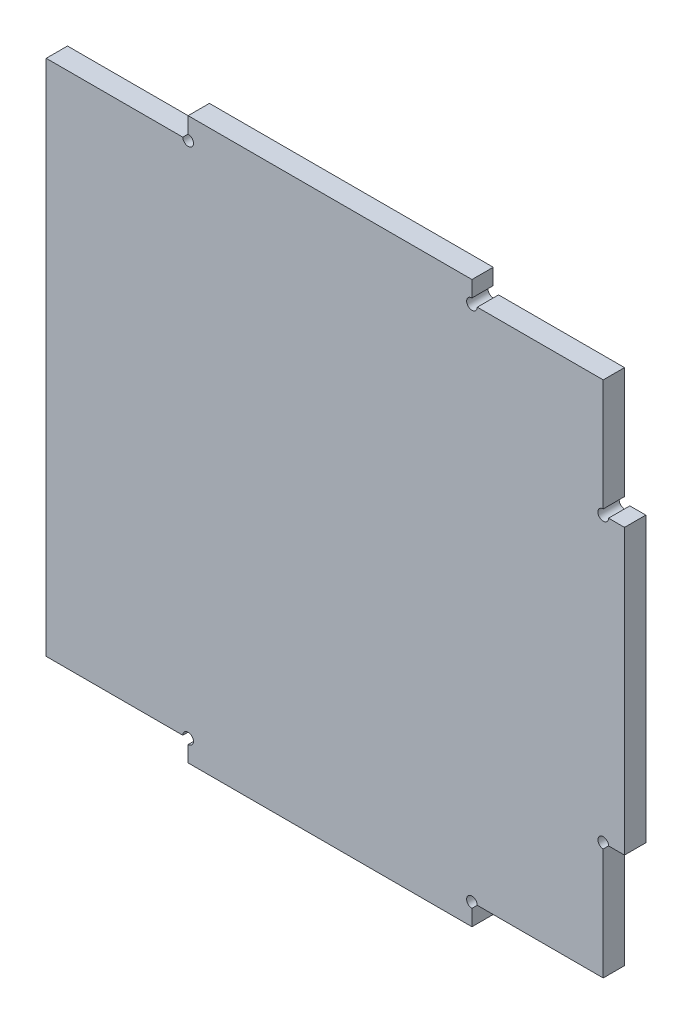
ISO-10303-21;
HEADER;
FILE_DESCRIPTION(('STEP AP214'),'2;1');
FILE_NAME('part.step','',(''),(''),'','','');
FILE_SCHEMA(('AUTOMOTIVE_DESIGN { 1 0 10303 214 1 1 1 1 }'));
ENDSEC;
DATA;
#1=APPLICATION_CONTEXT('core data for automotive mechanical design processes');
#2=APPLICATION_PROTOCOL_DEFINITION('international standard','automotive_design',2000,#1);
#3=PRODUCT_CONTEXT('',#1,'mechanical');
#4=PRODUCT('Part','Part','',(#3));
#5=PRODUCT_RELATED_PRODUCT_CATEGORY('part','',(#4));
#6=PRODUCT_DEFINITION_FORMATION('','',#4);
#7=PRODUCT_DEFINITION_CONTEXT('part definition',#1,'design');
#8=PRODUCT_DEFINITION('design','',#6,#7);
#9=PRODUCT_DEFINITION_SHAPE('','',#8);
#10=(LENGTH_UNIT() NAMED_UNIT(*) SI_UNIT(.MILLI.,.METRE.));
#11=(NAMED_UNIT(*) PLANE_ANGLE_UNIT() SI_UNIT($,.RADIAN.));
#12=(NAMED_UNIT(*) SI_UNIT($,.STERADIAN.) SOLID_ANGLE_UNIT());
#13=UNCERTAINTY_MEASURE_WITH_UNIT(LENGTH_MEASURE(1.E-05),#10,'distance_accuracy_value','');
#14=(GEOMETRIC_REPRESENTATION_CONTEXT(3) GLOBAL_UNCERTAINTY_ASSIGNED_CONTEXT((#13)) GLOBAL_UNIT_ASSIGNED_CONTEXT((#10,
#11,#12)) REPRESENTATION_CONTEXT('',''));
#15=CARTESIAN_POINT('',(0.,0.,0.));
#16=DIRECTION('',(0.,0.,1.));
#17=DIRECTION('',(1.,0.,0.));
#18=AXIS2_PLACEMENT_3D('',#15,#16,#17);
#19=CARTESIAN_POINT('',(-97.629050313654,-3.7639470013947,6.));
#20=DIRECTION('',(1.,0.,0.));
#21=DIRECTION('',(0.,0.,-1.));
#22=AXIS2_PLACEMENT_3D('',#19,#20,#21);
#23=PLANE('',#22);
#24=DIRECTION('',(0.,-1.,0.));
#25=VECTOR('',#24,1.);
#26=CARTESIAN_POINT('',(-97.629050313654,-3.7639470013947,0.));
#27=LINE('',#26,#25);
#28=CARTESIAN_POINT('',(-97.629050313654,142.236052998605,0.));
#29=VERTEX_POINT('',#28);
#30=CARTESIAN_POINT('',(-97.629050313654,-3.7639470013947,0.));
#31=VERTEX_POINT('',#30);
#32=EDGE_CURVE('E198',#29,#31,#27,.T.);
#33=ORIENTED_EDGE('',*,*,#32,.T.);
#34=DIRECTION('',(0.,0.,-1.));
#35=VECTOR('',#34,1.);
#36=CARTESIAN_POINT('',(-97.629050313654,-3.7639470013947,6.));
#37=LINE('',#36,#35);
#38=CARTESIAN_POINT('',(-97.629050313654,-3.7639470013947,6.));
#39=VERTEX_POINT('',#38);
#40=EDGE_CURVE('E258',#39,#31,#37,.T.);
#41=ORIENTED_EDGE('',*,*,#40,.F.);
#42=DIRECTION('',(0.,-1.,0.));
#43=VECTOR('',#42,1.);
#44=CARTESIAN_POINT('',(-97.629050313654,-3.7639470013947,6.));
#45=LINE('',#44,#43);
#46=CARTESIAN_POINT('',(-97.629050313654,142.236052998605,6.));
#47=VERTEX_POINT('',#46);
#48=EDGE_CURVE('E230',#47,#39,#45,.T.);
#49=ORIENTED_EDGE('',*,*,#48,.F.);
#50=DIRECTION('',(0.,0.,-1.));
#51=VECTOR('',#50,1.);
#52=CARTESIAN_POINT('',(-97.629050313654,142.236052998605,6.));
#53=LINE('',#52,#51);
#54=EDGE_CURVE('E231',#47,#29,#53,.T.);
#55=ORIENTED_EDGE('',*,*,#54,.T.);
#56=EDGE_LOOP('',(#33,#41,#49,#55));
#57=FACE_BOUND('',#56,.T.);
#58=ADVANCED_FACE('F30',(#57),#23,.F.);
#59=CARTESIAN_POINT('',(-57.629050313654,-3.76394700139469,6.));
#60=DIRECTION('',(0.,1.,0.));
#61=DIRECTION('',(-1.,0.,0.));
#62=AXIS2_PLACEMENT_3D('',#59,#60,#61);
#63=PLANE('',#62);
#64=DIRECTION('',(1.,0.,0.));
#65=VECTOR('',#64,1.);
#66=CARTESIAN_POINT('',(-57.629050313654,-3.76394700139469,0.));
#67=LINE('',#66,#65);
#68=CARTESIAN_POINT('',(-59.129050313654,-3.76394700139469,0.));
#69=VERTEX_POINT('',#68);
#70=EDGE_CURVE('E194',#31,#69,#67,.T.);
#71=ORIENTED_EDGE('',*,*,#70,.T.);
#72=DIRECTION('',(0.,0.,1.));
#73=VECTOR('',#72,1.);
#74=CARTESIAN_POINT('',(-59.129050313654,-3.76394700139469,0.));
#75=LINE('',#74,#73);
#76=CARTESIAN_POINT('',(-59.129050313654,-3.76394700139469,6.));
#77=VERTEX_POINT('',#76);
#78=EDGE_CURVE('E43',#69,#77,#75,.T.);
#79=ORIENTED_EDGE('',*,*,#78,.T.);
#80=DIRECTION('',(1.,0.,0.));
#81=VECTOR('',#80,1.);
#82=CARTESIAN_POINT('',(-57.629050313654,-3.76394700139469,6.));
#83=LINE('',#82,#81);
#84=EDGE_CURVE('E322',#39,#77,#83,.T.);
#85=ORIENTED_EDGE('',*,*,#84,.F.);
#86=ORIENTED_EDGE('',*,*,#40,.T.);
#87=EDGE_LOOP('',(#71,#79,#85,#86));
#88=FACE_BOUND('',#87,.T.);
#89=ADVANCED_FACE('F365',(#88),#63,.F.);
#90=CARTESIAN_POINT('',(-57.629050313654,-9.76394700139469,6.));
#91=DIRECTION('',(1.,0.,0.));
#92=DIRECTION('',(0.,0.,-1.));
#93=AXIS2_PLACEMENT_3D('',#90,#91,#92);
#94=PLANE('',#93);
#95=DIRECTION('',(0.,-1.,0.));
#96=VECTOR('',#95,1.);
#97=CARTESIAN_POINT('',(-57.629050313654,-9.76394700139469,6.));
#98=LINE('',#97,#96);
#99=CARTESIAN_POINT('',(-57.629050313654,-5.2639470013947,6.));
#100=VERTEX_POINT('',#99);
#101=CARTESIAN_POINT('',(-57.629050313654,-9.76394700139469,6.));
#102=VERTEX_POINT('',#101);
#103=EDGE_CURVE('E187',#100,#102,#98,.T.);
#104=ORIENTED_EDGE('',*,*,#103,.F.);
#105=DIRECTION('',(0.,0.,1.));
#106=VECTOR('',#105,1.);
#107=CARTESIAN_POINT('',(-57.629050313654,-5.2639470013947,0.));
#108=LINE('',#107,#106);
#109=CARTESIAN_POINT('',(-57.629050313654,-5.2639470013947,0.));
#110=VERTEX_POINT('',#109);
#111=EDGE_CURVE('E176',#100,#110,#108,.F.);
#112=ORIENTED_EDGE('',*,*,#111,.T.);
#113=DIRECTION('',(0.,-1.,0.));
#114=VECTOR('',#113,1.);
#115=CARTESIAN_POINT('',(-57.629050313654,-9.76394700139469,0.));
#116=LINE('',#115,#114);
#117=CARTESIAN_POINT('',(-57.629050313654,-9.76394700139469,0.));
#118=VERTEX_POINT('',#117);
#119=EDGE_CURVE('E185',#110,#118,#116,.T.);
#120=ORIENTED_EDGE('',*,*,#119,.T.);
#121=DIRECTION('',(0.,0.,-1.));
#122=VECTOR('',#121,1.);
#123=CARTESIAN_POINT('',(-57.629050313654,-9.76394700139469,6.));
#124=LINE('',#123,#122);
#125=EDGE_CURVE('E256',#102,#118,#124,.T.);
#126=ORIENTED_EDGE('',*,*,#125,.F.);
#127=EDGE_LOOP('',(#104,#112,#120,#126));
#128=FACE_BOUND('',#127,.T.);
#129=ADVANCED_FACE('F183',(#128),#94,.F.);
#130=CARTESIAN_POINT('',(22.370949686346,-9.76394700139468,6.));
#131=DIRECTION('',(0.,1.,0.));
#132=DIRECTION('',(-1.,0.,0.));
#133=AXIS2_PLACEMENT_3D('',#130,#131,#132);
#134=PLANE('',#133);
#135=DIRECTION('',(1.,0.,0.));
#136=VECTOR('',#135,1.);
#137=CARTESIAN_POINT('',(22.370949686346,-9.76394700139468,0.));
#138=LINE('',#137,#136);
#139=CARTESIAN_POINT('',(22.370949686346,-9.76394700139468,0.));
#140=VERTEX_POINT('',#139);
#141=EDGE_CURVE('E193',#118,#140,#138,.T.);
#142=ORIENTED_EDGE('',*,*,#141,.T.);
#143=DIRECTION('',(0.,0.,-1.));
#144=VECTOR('',#143,1.);
#145=CARTESIAN_POINT('',(22.370949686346,-9.76394700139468,6.));
#146=LINE('',#145,#144);
#147=CARTESIAN_POINT('',(22.370949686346,-9.76394700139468,6.));
#148=VERTEX_POINT('',#147);
#149=EDGE_CURVE('E253',#148,#140,#146,.T.);
#150=ORIENTED_EDGE('',*,*,#149,.F.);
#151=DIRECTION('',(1.,0.,0.));
#152=VECTOR('',#151,1.);
#153=CARTESIAN_POINT('',(22.370949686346,-9.76394700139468,6.));
#154=LINE('',#153,#152);
#155=EDGE_CURVE('E326',#102,#148,#154,.T.);
#156=ORIENTED_EDGE('',*,*,#155,.F.);
#157=ORIENTED_EDGE('',*,*,#125,.T.);
#158=EDGE_LOOP('',(#142,#150,#156,#157));
#159=FACE_BOUND('',#158,.T.);
#160=ADVANCED_FACE('F423',(#159),#134,.F.);
#161=CARTESIAN_POINT('',(22.370949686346,-3.76394700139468,6.));
#162=DIRECTION('',(-1.,0.,0.));
#163=DIRECTION('',(0.,-1.,0.));
#164=AXIS2_PLACEMENT_3D('',#161,#162,#163);
#165=PLANE('',#164);
#166=DIRECTION('',(0.,1.,0.));
#167=VECTOR('',#166,1.);
#168=CARTESIAN_POINT('',(22.370949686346,-3.76394700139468,0.));
#169=LINE('',#168,#167);
#170=CARTESIAN_POINT('',(22.370949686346,-5.26394700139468,0.));
#171=VERTEX_POINT('',#170);
#172=EDGE_CURVE('E196',#140,#171,#169,.T.);
#173=ORIENTED_EDGE('',*,*,#172,.T.);
#174=DIRECTION('',(0.,0.,1.));
#175=VECTOR('',#174,1.);
#176=CARTESIAN_POINT('',(22.370949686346,-5.26394700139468,0.));
#177=LINE('',#176,#175);
#178=CARTESIAN_POINT('',(22.370949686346,-5.26394700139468,6.));
#179=VERTEX_POINT('',#178);
#180=EDGE_CURVE('E51',#171,#179,#177,.T.);
#181=ORIENTED_EDGE('',*,*,#180,.T.);
#182=DIRECTION('',(0.,1.,0.));
#183=VECTOR('',#182,1.);
#184=CARTESIAN_POINT('',(22.370949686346,-3.76394700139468,6.));
#185=LINE('',#184,#183);
#186=EDGE_CURVE('E328',#148,#179,#185,.T.);
#187=ORIENTED_EDGE('',*,*,#186,.F.);
#188=ORIENTED_EDGE('',*,*,#149,.T.);
#189=EDGE_LOOP('',(#173,#181,#187,#188));
#190=FACE_BOUND('',#189,.T.);
#191=ADVANCED_FACE('F428',(#190),#165,.F.);
#192=CARTESIAN_POINT('',(59.370949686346,-3.76394700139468,6.));
#193=DIRECTION('',(0.,1.,0.));
#194=DIRECTION('',(-1.,0.,0.));
#195=AXIS2_PLACEMENT_3D('',#192,#193,#194);
#196=PLANE('',#195);
#197=DIRECTION('',(1.,0.,0.));
#198=VECTOR('',#197,1.);
#199=CARTESIAN_POINT('',(59.370949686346,-3.76394700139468,6.));
#200=LINE('',#199,#198);
#201=CARTESIAN_POINT('',(23.870949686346,-3.76394700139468,6.));
#202=VERTEX_POINT('',#201);
#203=CARTESIAN_POINT('',(59.370949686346,-3.76394700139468,6.));
#204=VERTEX_POINT('',#203);
#205=EDGE_CURVE('E331',#202,#204,#200,.T.);
#206=ORIENTED_EDGE('',*,*,#205,.F.);
#207=DIRECTION('',(0.,0.,1.));
#208=VECTOR('',#207,1.);
#209=CARTESIAN_POINT('',(23.870949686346,-3.76394700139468,0.));
#210=LINE('',#209,#208);
#211=CARTESIAN_POINT('',(23.870949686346,-3.76394700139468,0.));
#212=VERTEX_POINT('',#211);
#213=EDGE_CURVE('E372',#202,#212,#210,.F.);
#214=ORIENTED_EDGE('',*,*,#213,.T.);
#215=DIRECTION('',(1.,0.,0.));
#216=VECTOR('',#215,1.);
#217=CARTESIAN_POINT('',(59.370949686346,-3.76394700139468,0.));
#218=LINE('',#217,#216);
#219=CARTESIAN_POINT('',(59.370949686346,-3.76394700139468,0.));
#220=VERTEX_POINT('',#219);
#221=EDGE_CURVE('E204',#212,#220,#218,.T.);
#222=ORIENTED_EDGE('',*,*,#221,.T.);
#223=DIRECTION('',(0.,0.,-1.));
#224=VECTOR('',#223,1.);
#225=CARTESIAN_POINT('',(59.370949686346,-3.76394700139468,6.));
#226=LINE('',#225,#224);
#227=EDGE_CURVE('E250',#204,#220,#226,.T.);
#228=ORIENTED_EDGE('',*,*,#227,.F.);
#229=EDGE_LOOP('',(#206,#214,#222,#228));
#230=FACE_BOUND('',#229,.T.);
#231=ADVANCED_FACE('F398',(#230),#196,.F.);
#232=CARTESIAN_POINT('',(59.370949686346,29.2360529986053,6.));
#233=DIRECTION('',(-1.,0.,0.));
#234=DIRECTION('',(0.,-1.,0.));
#235=AXIS2_PLACEMENT_3D('',#232,#233,#234);
#236=PLANE('',#235);
#237=DIRECTION('',(0.,1.,0.));
#238=VECTOR('',#237,1.);
#239=CARTESIAN_POINT('',(59.370949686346,29.2360529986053,0.));
#240=LINE('',#239,#238);
#241=CARTESIAN_POINT('',(59.370949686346,27.7360529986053,0.));
#242=VERTEX_POINT('',#241);
#243=EDGE_CURVE('E206',#220,#242,#240,.T.);
#244=ORIENTED_EDGE('',*,*,#243,.T.);
#245=DIRECTION('',(0.,0.,1.));
#246=VECTOR('',#245,1.);
#247=CARTESIAN_POINT('',(59.370949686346,27.7360529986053,0.));
#248=LINE('',#247,#246);
#249=CARTESIAN_POINT('',(59.370949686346,27.7360529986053,6.));
#250=VERTEX_POINT('',#249);
#251=EDGE_CURVE('E385',#242,#250,#248,.T.);
#252=ORIENTED_EDGE('',*,*,#251,.T.);
#253=DIRECTION('',(0.,1.,0.));
#254=VECTOR('',#253,1.);
#255=CARTESIAN_POINT('',(59.370949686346,29.2360529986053,6.));
#256=LINE('',#255,#254);
#257=EDGE_CURVE('E333',#204,#250,#256,.T.);
#258=ORIENTED_EDGE('',*,*,#257,.F.);
#259=ORIENTED_EDGE('',*,*,#227,.T.);
#260=EDGE_LOOP('',(#244,#252,#258,#259));
#261=FACE_BOUND('',#260,.T.);
#262=ADVANCED_FACE('F389',(#261),#236,.F.);
#263=CARTESIAN_POINT('',(65.370949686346,29.2360529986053,6.));
#264=DIRECTION('',(0.,1.,0.));
#265=DIRECTION('',(0.,0.,1.));
#266=AXIS2_PLACEMENT_3D('',#263,#264,#265);
#267=PLANE('',#266);
#268=DIRECTION('',(1.,0.,0.));
#269=VECTOR('',#268,1.);
#270=CARTESIAN_POINT('',(65.370949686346,29.2360529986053,6.));
#271=LINE('',#270,#269);
#272=CARTESIAN_POINT('',(60.870949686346,29.2360529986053,6.));
#273=VERTEX_POINT('',#272);
#274=CARTESIAN_POINT('',(65.370949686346,29.2360529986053,6.));
#275=VERTEX_POINT('',#274);
#276=EDGE_CURVE('E336',#273,#275,#271,.T.);
#277=ORIENTED_EDGE('',*,*,#276,.F.);
#278=DIRECTION('',(0.,0.,1.));
#279=VECTOR('',#278,1.);
#280=CARTESIAN_POINT('',(60.870949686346,29.2360529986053,0.));
#281=LINE('',#280,#279);
#282=CARTESIAN_POINT('',(60.870949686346,29.2360529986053,0.));
#283=VERTEX_POINT('',#282);
#284=EDGE_CURVE('E381',#273,#283,#281,.F.);
#285=ORIENTED_EDGE('',*,*,#284,.T.);
#286=DIRECTION('',(1.,0.,0.));
#287=VECTOR('',#286,1.);
#288=CARTESIAN_POINT('',(65.370949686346,29.2360529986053,0.));
#289=LINE('',#288,#287);
#290=CARTESIAN_POINT('',(65.370949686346,29.2360529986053,0.));
#291=VERTEX_POINT('',#290);
#292=EDGE_CURVE('E209',#283,#291,#289,.T.);
#293=ORIENTED_EDGE('',*,*,#292,.T.);
#294=DIRECTION('',(0.,0.,-1.));
#295=VECTOR('',#294,1.);
#296=CARTESIAN_POINT('',(65.370949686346,29.2360529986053,6.));
#297=LINE('',#296,#295);
#298=EDGE_CURVE('E247',#275,#291,#297,.T.);
#299=ORIENTED_EDGE('',*,*,#298,.F.);
#300=EDGE_LOOP('',(#277,#285,#293,#299));
#301=FACE_BOUND('',#300,.T.);
#302=ADVANCED_FACE('F404',(#301),#267,.F.);
#303=CARTESIAN_POINT('',(65.370949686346,109.236052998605,6.));
#304=DIRECTION('',(-1.,0.,0.));
#305=DIRECTION('',(0.,0.,1.));
#306=AXIS2_PLACEMENT_3D('',#303,#304,#305);
#307=PLANE('',#306);
#308=DIRECTION('',(0.,1.,0.));
#309=VECTOR('',#308,1.);
#310=CARTESIAN_POINT('',(65.370949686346,109.236052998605,0.));
#311=LINE('',#310,#309);
#312=CARTESIAN_POINT('',(65.370949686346,109.236052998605,0.));
#313=VERTEX_POINT('',#312);
#314=EDGE_CURVE('E211',#291,#313,#311,.T.);
#315=ORIENTED_EDGE('',*,*,#314,.T.);
#316=DIRECTION('',(0.,0.,-1.));
#317=VECTOR('',#316,1.);
#318=CARTESIAN_POINT('',(65.370949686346,109.236052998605,6.));
#319=LINE('',#318,#317);
#320=CARTESIAN_POINT('',(65.370949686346,109.236052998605,6.));
#321=VERTEX_POINT('',#320);
#322=EDGE_CURVE('E244',#321,#313,#319,.T.);
#323=ORIENTED_EDGE('',*,*,#322,.F.);
#324=DIRECTION('',(0.,1.,0.));
#325=VECTOR('',#324,1.);
#326=CARTESIAN_POINT('',(65.370949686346,109.236052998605,6.));
#327=LINE('',#326,#325);
#328=EDGE_CURVE('E338',#275,#321,#327,.T.);
#329=ORIENTED_EDGE('',*,*,#328,.F.);
#330=ORIENTED_EDGE('',*,*,#298,.T.);
#331=EDGE_LOOP('',(#315,#323,#329,#330));
#332=FACE_BOUND('',#331,.T.);
#333=ADVANCED_FACE('F407',(#332),#307,.F.);
#334=CARTESIAN_POINT('',(59.370949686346,109.236052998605,6.));
#335=DIRECTION('',(0.,-1.,0.));
#336=DIRECTION('',(1.,0.,0.));
#337=AXIS2_PLACEMENT_3D('',#334,#335,#336);
#338=PLANE('',#337);
#339=DIRECTION('',(-1.,0.,0.));
#340=VECTOR('',#339,1.);
#341=CARTESIAN_POINT('',(59.370949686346,109.236052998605,0.));
#342=LINE('',#341,#340);
#343=CARTESIAN_POINT('',(60.870949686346,109.236052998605,0.));
#344=VERTEX_POINT('',#343);
#345=EDGE_CURVE('E213',#313,#344,#342,.T.);
#346=ORIENTED_EDGE('',*,*,#345,.T.);
#347=DIRECTION('',(0.,0.,1.));
#348=VECTOR('',#347,1.);
#349=CARTESIAN_POINT('',(60.870949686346,109.236052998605,0.));
#350=LINE('',#349,#348);
#351=CARTESIAN_POINT('',(60.870949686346,109.236052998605,6.));
#352=VERTEX_POINT('',#351);
#353=EDGE_CURVE('E271',#344,#352,#350,.T.);
#354=ORIENTED_EDGE('',*,*,#353,.T.);
#355=DIRECTION('',(-1.,0.,0.));
#356=VECTOR('',#355,1.);
#357=CARTESIAN_POINT('',(59.370949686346,109.236052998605,6.));
#358=LINE('',#357,#356);
#359=EDGE_CURVE('E297',#321,#352,#358,.T.);
#360=ORIENTED_EDGE('',*,*,#359,.F.);
#361=ORIENTED_EDGE('',*,*,#322,.T.);
#362=EDGE_LOOP('',(#346,#354,#360,#361));
#363=FACE_BOUND('',#362,.T.);
#364=ADVANCED_FACE('F345',(#363),#338,.F.);
#365=CARTESIAN_POINT('',(59.370949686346,142.236052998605,6.));
#366=DIRECTION('',(-1.,0.,0.));
#367=DIRECTION('',(0.,-1.,0.));
#368=AXIS2_PLACEMENT_3D('',#365,#366,#367);
#369=PLANE('',#368);
#370=DIRECTION('',(0.,1.,0.));
#371=VECTOR('',#370,1.);
#372=CARTESIAN_POINT('',(59.370949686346,142.236052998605,6.));
#373=LINE('',#372,#371);
#374=CARTESIAN_POINT('',(59.370949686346,110.736052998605,6.));
#375=VERTEX_POINT('',#374);
#376=CARTESIAN_POINT('',(59.370949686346,142.236052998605,6.));
#377=VERTEX_POINT('',#376);
#378=EDGE_CURVE('E278',#375,#377,#373,.T.);
#379=ORIENTED_EDGE('',*,*,#378,.F.);
#380=DIRECTION('',(0.,0.,1.));
#381=VECTOR('',#380,1.);
#382=CARTESIAN_POINT('',(59.370949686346,110.736052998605,0.));
#383=LINE('',#382,#381);
#384=CARTESIAN_POINT('',(59.370949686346,110.736052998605,0.));
#385=VERTEX_POINT('',#384);
#386=EDGE_CURVE('E268',#375,#385,#383,.F.);
#387=ORIENTED_EDGE('',*,*,#386,.T.);
#388=DIRECTION('',(0.,1.,0.));
#389=VECTOR('',#388,1.);
#390=CARTESIAN_POINT('',(59.370949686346,142.236052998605,0.));
#391=LINE('',#390,#389);
#392=CARTESIAN_POINT('',(59.370949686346,142.236052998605,0.));
#393=VERTEX_POINT('',#392);
#394=EDGE_CURVE('E216',#385,#393,#391,.T.);
#395=ORIENTED_EDGE('',*,*,#394,.T.);
#396=DIRECTION('',(0.,0.,-1.));
#397=VECTOR('',#396,1.);
#398=CARTESIAN_POINT('',(59.370949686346,142.236052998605,6.));
#399=LINE('',#398,#397);
#400=EDGE_CURVE('E241',#377,#393,#399,.T.);
#401=ORIENTED_EDGE('',*,*,#400,.F.);
#402=EDGE_LOOP('',(#379,#387,#395,#401));
#403=FACE_BOUND('',#402,.T.);
#404=ADVANCED_FACE('F276',(#403),#369,.F.);
#405=CARTESIAN_POINT('',(22.3709496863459,142.236052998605,6.));
#406=DIRECTION('',(0.,-1.,0.));
#407=DIRECTION('',(0.,0.,-1.));
#408=AXIS2_PLACEMENT_3D('',#405,#406,#407);
#409=PLANE('',#408);
#410=DIRECTION('',(-1.,0.,0.));
#411=VECTOR('',#410,1.);
#412=CARTESIAN_POINT('',(22.3709496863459,142.236052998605,0.));
#413=LINE('',#412,#411);
#414=CARTESIAN_POINT('',(23.8709496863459,142.236052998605,0.));
#415=VERTEX_POINT('',#414);
#416=EDGE_CURVE('E218',#393,#415,#413,.T.);
#417=ORIENTED_EDGE('',*,*,#416,.T.);
#418=DIRECTION('',(0.,0.,1.));
#419=VECTOR('',#418,1.);
#420=CARTESIAN_POINT('',(23.8709496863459,142.236052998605,0.));
#421=LINE('',#420,#419);
#422=CARTESIAN_POINT('',(23.8709496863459,142.236052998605,6.));
#423=VERTEX_POINT('',#422);
#424=EDGE_CURVE('E288',#415,#423,#421,.T.);
#425=ORIENTED_EDGE('',*,*,#424,.T.);
#426=DIRECTION('',(-1.,0.,0.));
#427=VECTOR('',#426,1.);
#428=CARTESIAN_POINT('',(22.3709496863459,142.236052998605,6.));
#429=LINE('',#428,#427);
#430=EDGE_CURVE('E290',#377,#423,#429,.T.);
#431=ORIENTED_EDGE('',*,*,#430,.F.);
#432=ORIENTED_EDGE('',*,*,#400,.T.);
#433=EDGE_LOOP('',(#417,#425,#431,#432));
#434=FACE_BOUND('',#433,.T.);
#435=ADVANCED_FACE('F286',(#434),#409,.F.);
#436=CARTESIAN_POINT('',(22.3709496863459,148.236052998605,6.));
#437=DIRECTION('',(-1.,0.,0.));
#438=DIRECTION('',(0.,0.,1.));
#439=AXIS2_PLACEMENT_3D('',#436,#437,#438);
#440=PLANE('',#439);
#441=DIRECTION('',(0.,1.,0.));
#442=VECTOR('',#441,1.);
#443=CARTESIAN_POINT('',(22.3709496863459,148.236052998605,6.));
#444=LINE('',#443,#442);
#445=CARTESIAN_POINT('',(22.3709496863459,143.736052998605,6.));
#446=VERTEX_POINT('',#445);
#447=CARTESIAN_POINT('',(22.3709496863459,148.236052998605,6.));
#448=VERTEX_POINT('',#447);
#449=EDGE_CURVE('E293',#446,#448,#444,.T.);
#450=ORIENTED_EDGE('',*,*,#449,.F.);
#451=DIRECTION('',(0.,0.,1.));
#452=VECTOR('',#451,1.);
#453=CARTESIAN_POINT('',(22.3709496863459,143.736052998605,0.));
#454=LINE('',#453,#452);
#455=CARTESIAN_POINT('',(22.3709496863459,143.736052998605,0.));
#456=VERTEX_POINT('',#455);
#457=EDGE_CURVE('E348',#446,#456,#454,.F.);
#458=ORIENTED_EDGE('',*,*,#457,.T.);
#459=DIRECTION('',(0.,1.,0.));
#460=VECTOR('',#459,1.);
#461=CARTESIAN_POINT('',(22.3709496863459,148.236052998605,0.));
#462=LINE('',#461,#460);
#463=CARTESIAN_POINT('',(22.3709496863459,148.236052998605,0.));
#464=VERTEX_POINT('',#463);
#465=EDGE_CURVE('E221',#456,#464,#462,.T.);
#466=ORIENTED_EDGE('',*,*,#465,.T.);
#467=DIRECTION('',(0.,0.,-1.));
#468=VECTOR('',#467,1.);
#469=CARTESIAN_POINT('',(22.3709496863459,148.236052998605,6.));
#470=LINE('',#469,#468);
#471=EDGE_CURVE('E238',#448,#464,#470,.T.);
#472=ORIENTED_EDGE('',*,*,#471,.F.);
#473=EDGE_LOOP('',(#450,#458,#466,#472));
#474=FACE_BOUND('',#473,.T.);
#475=ADVANCED_FACE('F468',(#474),#440,.F.);
#476=CARTESIAN_POINT('',(-57.6290503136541,148.236052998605,6.));
#477=DIRECTION('',(0.,-1.,0.));
#478=DIRECTION('',(1.,0.,0.));
#479=AXIS2_PLACEMENT_3D('',#476,#477,#478);
#480=PLANE('',#479);
#481=DIRECTION('',(-1.,0.,0.));
#482=VECTOR('',#481,1.);
#483=CARTESIAN_POINT('',(-57.6290503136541,148.236052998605,0.));
#484=LINE('',#483,#482);
#485=CARTESIAN_POINT('',(-57.6290503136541,148.236052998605,0.));
#486=VERTEX_POINT('',#485);
#487=EDGE_CURVE('E223',#464,#486,#484,.T.);
#488=ORIENTED_EDGE('',*,*,#487,.T.);
#489=DIRECTION('',(0.,0.,-1.));
#490=VECTOR('',#489,1.);
#491=CARTESIAN_POINT('',(-57.6290503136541,148.236052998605,6.));
#492=LINE('',#491,#490);
#493=CARTESIAN_POINT('',(-57.6290503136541,148.236052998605,6.));
#494=VERTEX_POINT('',#493);
#495=EDGE_CURVE('E234',#494,#486,#492,.T.);
#496=ORIENTED_EDGE('',*,*,#495,.F.);
#497=DIRECTION('',(-1.,0.,0.));
#498=VECTOR('',#497,1.);
#499=CARTESIAN_POINT('',(-57.6290503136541,148.236052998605,6.));
#500=LINE('',#499,#498);
#501=EDGE_CURVE('E295',#448,#494,#500,.T.);
#502=ORIENTED_EDGE('',*,*,#501,.F.);
#503=ORIENTED_EDGE('',*,*,#471,.T.);
#504=EDGE_LOOP('',(#488,#496,#502,#503));
#505=FACE_BOUND('',#504,.T.);
#506=ADVANCED_FACE('F477',(#505),#480,.F.);
#507=CARTESIAN_POINT('',(-57.6290503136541,142.236052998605,6.));
#508=DIRECTION('',(1.,0.,0.));
#509=DIRECTION('',(0.,0.,-1.));
#510=AXIS2_PLACEMENT_3D('',#507,#508,#509);
#511=PLANE('',#510);
#512=DIRECTION('',(0.,-1.,0.));
#513=VECTOR('',#512,1.);
#514=CARTESIAN_POINT('',(-57.6290503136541,142.236052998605,0.));
#515=LINE('',#514,#513);
#516=CARTESIAN_POINT('',(-57.6290503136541,143.736052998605,0.));
#517=VERTEX_POINT('',#516);
#518=EDGE_CURVE('E225',#486,#517,#515,.T.);
#519=ORIENTED_EDGE('',*,*,#518,.T.);
#520=DIRECTION('',(0.,0.,1.));
#521=VECTOR('',#520,1.);
#522=CARTESIAN_POINT('',(-57.6290503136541,143.736052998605,0.));
#523=LINE('',#522,#521);
#524=CARTESIAN_POINT('',(-57.6290503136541,143.736052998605,6.));
#525=VERTEX_POINT('',#524);
#526=EDGE_CURVE('E306',#517,#525,#523,.T.);
#527=ORIENTED_EDGE('',*,*,#526,.T.);
#528=DIRECTION('',(0.,-1.,0.));
#529=VECTOR('',#528,1.);
#530=CARTESIAN_POINT('',(-57.6290503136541,142.236052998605,6.));
#531=LINE('',#530,#529);
#532=EDGE_CURVE('E302',#494,#525,#531,.T.);
#533=ORIENTED_EDGE('',*,*,#532,.F.);
#534=ORIENTED_EDGE('',*,*,#495,.T.);
#535=EDGE_LOOP('',(#519,#527,#533,#534));
#536=FACE_BOUND('',#535,.T.);
#537=ADVANCED_FACE('F485',(#536),#511,.F.);
#538=CARTESIAN_POINT('',(-97.629050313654,142.236052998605,6.));
#539=DIRECTION('',(0.,-1.,0.));
#540=DIRECTION('',(0.,0.,-1.));
#541=AXIS2_PLACEMENT_3D('',#538,#539,#540);
#542=PLANE('',#541);
#543=DIRECTION('',(-1.,0.,0.));
#544=VECTOR('',#543,1.);
#545=CARTESIAN_POINT('',(-97.629050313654,142.236052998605,6.));
#546=LINE('',#545,#544);
#547=CARTESIAN_POINT('',(-59.1290503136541,142.236052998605,6.));
#548=VERTEX_POINT('',#547);
#549=EDGE_CURVE('E235',#548,#47,#546,.T.);
#550=ORIENTED_EDGE('',*,*,#549,.F.);
#551=DIRECTION('',(0.,0.,1.));
#552=VECTOR('',#551,1.);
#553=CARTESIAN_POINT('',(-59.1290503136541,142.236052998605,0.));
#554=LINE('',#553,#552);
#555=CARTESIAN_POINT('',(-59.1290503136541,142.236052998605,0.));
#556=VERTEX_POINT('',#555);
#557=EDGE_CURVE('E311',#548,#556,#554,.F.);
#558=ORIENTED_EDGE('',*,*,#557,.T.);
#559=DIRECTION('',(-1.,0.,0.));
#560=VECTOR('',#559,1.);
#561=CARTESIAN_POINT('',(-97.629050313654,142.236052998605,0.));
#562=LINE('',#561,#560);
#563=EDGE_CURVE('E228',#556,#29,#562,.T.);
#564=ORIENTED_EDGE('',*,*,#563,.T.);
#565=ORIENTED_EDGE('',*,*,#54,.F.);
#566=EDGE_LOOP('',(#550,#558,#564,#565));
#567=FACE_BOUND('',#566,.T.);
#568=ADVANCED_FACE('F361',(#567),#542,.F.);
#569=CARTESIAN_POINT('',(-97.629050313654,142.236052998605,6.));
#570=DIRECTION('',(0.,0.,-1.));
#571=DIRECTION('',(-1.,0.,0.));
#572=AXIS2_PLACEMENT_3D('',#569,#570,#571);
#573=PLANE('',#572);
#574=ORIENTED_EDGE('',*,*,#84,.T.);
#575=CARTESIAN_POINT('',(-57.629050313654,-3.76394700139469,6.));
#576=DIRECTION('',(0.,0.,1.));
#577=DIRECTION('',(1.,0.,0.));
#578=AXIS2_PLACEMENT_3D('',#575,#576,#577);
#579=CIRCLE('',#578,1.5);
#580=EDGE_CURVE('E188',#100,#77,#579,.T.);
#581=ORIENTED_EDGE('',*,*,#580,.F.);
#582=ORIENTED_EDGE('',*,*,#103,.T.);
#583=ORIENTED_EDGE('',*,*,#155,.T.);
#584=ORIENTED_EDGE('',*,*,#186,.T.);
#585=CARTESIAN_POINT('',(22.370949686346,-3.76394700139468,6.));
#586=DIRECTION('',(0.,0.,1.));
#587=DIRECTION('',(1.,0.,0.));
#588=AXIS2_PLACEMENT_3D('',#585,#586,#587);
#589=CIRCLE('',#588,1.5);
#590=EDGE_CURVE('E366',#202,#179,#589,.T.);
#591=ORIENTED_EDGE('',*,*,#590,.F.);
#592=ORIENTED_EDGE('',*,*,#205,.T.);
#593=ORIENTED_EDGE('',*,*,#257,.T.);
#594=CARTESIAN_POINT('',(59.370949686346,29.2360529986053,6.));
#595=DIRECTION('',(0.,0.,1.));
#596=DIRECTION('',(1.,0.,0.));
#597=AXIS2_PLACEMENT_3D('',#594,#595,#596);
#598=CIRCLE('',#597,1.5);
#599=EDGE_CURVE('E377',#273,#250,#598,.T.);
#600=ORIENTED_EDGE('',*,*,#599,.F.);
#601=ORIENTED_EDGE('',*,*,#276,.T.);
#602=ORIENTED_EDGE('',*,*,#328,.T.);
#603=ORIENTED_EDGE('',*,*,#359,.T.);
#604=CARTESIAN_POINT('',(59.370949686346,109.236052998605,6.));
#605=DIRECTION('',(0.,0.,1.));
#606=DIRECTION('',(1.,0.,0.));
#607=AXIS2_PLACEMENT_3D('',#604,#605,#606);
#608=CIRCLE('',#607,1.5);
#609=EDGE_CURVE('E279',#375,#352,#608,.T.);
#610=ORIENTED_EDGE('',*,*,#609,.F.);
#611=ORIENTED_EDGE('',*,*,#378,.T.);
#612=ORIENTED_EDGE('',*,*,#430,.T.);
#613=CARTESIAN_POINT('',(22.3709496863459,142.236052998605,6.));
#614=DIRECTION('',(0.,0.,1.));
#615=DIRECTION('',(1.,0.,0.));
#616=AXIS2_PLACEMENT_3D('',#613,#614,#615);
#617=CIRCLE('',#616,1.5);
#618=EDGE_CURVE('E346',#446,#423,#617,.T.);
#619=ORIENTED_EDGE('',*,*,#618,.F.);
#620=ORIENTED_EDGE('',*,*,#449,.T.);
#621=ORIENTED_EDGE('',*,*,#501,.T.);
#622=ORIENTED_EDGE('',*,*,#532,.T.);
#623=CARTESIAN_POINT('',(-57.6290503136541,142.236052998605,6.));
#624=DIRECTION('',(0.,0.,1.));
#625=DIRECTION('',(1.,0.,0.));
#626=AXIS2_PLACEMENT_3D('',#623,#624,#625);
#627=CIRCLE('',#626,1.5);
#628=EDGE_CURVE('E316',#548,#525,#627,.T.);
#629=ORIENTED_EDGE('',*,*,#628,.F.);
#630=ORIENTED_EDGE('',*,*,#549,.T.);
#631=ORIENTED_EDGE('',*,*,#48,.T.);
#632=EDGE_LOOP('',(#574,#581,#582,#583,#584,#591,#592,#593,#600,#601,#602,#603,#610,#611,#612,
#619,#620,#621,#622,#629,#630,#631));
#633=FACE_BOUND('',#632,.T.);
#634=ADVANCED_FACE('F341',(#633),#573,.F.);
#635=CARTESIAN_POINT('',(-97.629050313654,142.236052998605,0.));
#636=DIRECTION('',(0.,0.,-1.));
#637=DIRECTION('',(-1.,0.,0.));
#638=AXIS2_PLACEMENT_3D('',#635,#636,#637);
#639=PLANE('',#638);
#640=CARTESIAN_POINT('',(-57.629050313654,-3.76394700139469,0.));
#641=DIRECTION('',(0.,0.,-1.));
#642=DIRECTION('',(-1.,0.,0.));
#643=AXIS2_PLACEMENT_3D('',#640,#641,#642);
#644=CIRCLE('',#643,1.5);
#645=EDGE_CURVE('E11',#69,#110,#644,.T.);
#646=ORIENTED_EDGE('',*,*,#645,.F.);
#647=ORIENTED_EDGE('',*,*,#70,.F.);
#648=ORIENTED_EDGE('',*,*,#32,.F.);
#649=ORIENTED_EDGE('',*,*,#563,.F.);
#650=CARTESIAN_POINT('',(-57.6290503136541,142.236052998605,0.));
#651=DIRECTION('',(0.,0.,-1.));
#652=DIRECTION('',(-1.,0.,0.));
#653=AXIS2_PLACEMENT_3D('',#650,#651,#652);
#654=CIRCLE('',#653,1.5);
#655=EDGE_CURVE('E261',#517,#556,#654,.T.);
#656=ORIENTED_EDGE('',*,*,#655,.F.);
#657=ORIENTED_EDGE('',*,*,#518,.F.);
#658=ORIENTED_EDGE('',*,*,#487,.F.);
#659=ORIENTED_EDGE('',*,*,#465,.F.);
#660=CARTESIAN_POINT('',(22.3709496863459,142.236052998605,0.));
#661=DIRECTION('',(0.,0.,-1.));
#662=DIRECTION('',(-1.,0.,0.));
#663=AXIS2_PLACEMENT_3D('',#660,#661,#662);
#664=CIRCLE('',#663,1.5);
#665=EDGE_CURVE('E263',#415,#456,#664,.T.);
#666=ORIENTED_EDGE('',*,*,#665,.F.);
#667=ORIENTED_EDGE('',*,*,#416,.F.);
#668=ORIENTED_EDGE('',*,*,#394,.F.);
#669=CARTESIAN_POINT('',(59.370949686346,109.236052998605,0.));
#670=DIRECTION('',(0.,0.,-1.));
#671=DIRECTION('',(-1.,0.,0.));
#672=AXIS2_PLACEMENT_3D('',#669,#670,#671);
#673=CIRCLE('',#672,1.5);
#674=EDGE_CURVE('E37',#344,#385,#673,.T.);
#675=ORIENTED_EDGE('',*,*,#674,.F.);
#676=ORIENTED_EDGE('',*,*,#345,.F.);
#677=ORIENTED_EDGE('',*,*,#314,.F.);
#678=ORIENTED_EDGE('',*,*,#292,.F.);
#679=CARTESIAN_POINT('',(59.370949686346,29.2360529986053,0.));
#680=DIRECTION('',(0.,0.,1.));
#681=DIRECTION('',(1.,0.,0.));
#682=AXIS2_PLACEMENT_3D('',#679,#680,#681);
#683=CIRCLE('',#682,1.5);
#684=EDGE_CURVE('E378',#283,#242,#683,.T.);
#685=ORIENTED_EDGE('',*,*,#684,.T.);
#686=ORIENTED_EDGE('',*,*,#243,.F.);
#687=ORIENTED_EDGE('',*,*,#221,.F.);
#688=CARTESIAN_POINT('',(22.370949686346,-3.76394700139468,0.));
#689=DIRECTION('',(0.,0.,1.));
#690=DIRECTION('',(1.,0.,0.));
#691=AXIS2_PLACEMENT_3D('',#688,#689,#690);
#692=CIRCLE('',#691,1.5);
#693=EDGE_CURVE('E368',#212,#171,#692,.T.);
#694=ORIENTED_EDGE('',*,*,#693,.T.);
#695=ORIENTED_EDGE('',*,*,#172,.F.);
#696=ORIENTED_EDGE('',*,*,#141,.F.);
#697=ORIENTED_EDGE('',*,*,#119,.F.);
#698=EDGE_LOOP('',(#646,#647,#648,#649,#656,#657,#658,#659,#666,#667,#668,#675,#676,#677,#678,
#685,#686,#687,#694,#695,#696,#697));
#699=FACE_BOUND('',#698,.T.);
#700=ADVANCED_FACE('F191',(#699),#639,.T.);
#701=CARTESIAN_POINT('',(-57.6290503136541,142.236052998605,0.));
#702=DIRECTION('',(0.,0.,1.));
#703=DIRECTION('',(1.,0.,0.));
#704=AXIS2_PLACEMENT_3D('',#701,#702,#703);
#705=CYLINDRICAL_SURFACE('',#704,1.5);
#706=ORIENTED_EDGE('',*,*,#655,.T.);
#707=ORIENTED_EDGE('',*,*,#557,.F.);
#708=ORIENTED_EDGE('',*,*,#628,.T.);
#709=ORIENTED_EDGE('',*,*,#526,.F.);
#710=EDGE_LOOP('',(#706,#707,#708,#709));
#711=FACE_BOUND('',#710,.T.);
#712=ADVANCED_FACE('F356',(#711),#705,.F.);
#713=CARTESIAN_POINT('',(22.3709496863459,142.236052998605,0.));
#714=DIRECTION('',(0.,0.,1.));
#715=DIRECTION('',(1.,0.,0.));
#716=AXIS2_PLACEMENT_3D('',#713,#714,#715);
#717=CYLINDRICAL_SURFACE('',#716,1.5);
#718=ORIENTED_EDGE('',*,*,#665,.T.);
#719=ORIENTED_EDGE('',*,*,#457,.F.);
#720=ORIENTED_EDGE('',*,*,#618,.T.);
#721=ORIENTED_EDGE('',*,*,#424,.F.);
#722=EDGE_LOOP('',(#718,#719,#720,#721));
#723=FACE_BOUND('',#722,.T.);
#724=ADVANCED_FACE('F522',(#723),#717,.F.);
#725=CARTESIAN_POINT('',(59.370949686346,109.236052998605,0.));
#726=DIRECTION('',(0.,0.,1.));
#727=DIRECTION('',(1.,0.,0.));
#728=AXIS2_PLACEMENT_3D('',#725,#726,#727);
#729=CYLINDRICAL_SURFACE('',#728,1.5);
#730=ORIENTED_EDGE('',*,*,#674,.T.);
#731=ORIENTED_EDGE('',*,*,#386,.F.);
#732=ORIENTED_EDGE('',*,*,#609,.T.);
#733=ORIENTED_EDGE('',*,*,#353,.F.);
#734=EDGE_LOOP('',(#730,#731,#732,#733));
#735=FACE_BOUND('',#734,.T.);
#736=ADVANCED_FACE('F267',(#735),#729,.F.);
#737=CARTESIAN_POINT('',(59.370949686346,29.2360529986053,0.));
#738=DIRECTION('',(0.,0.,1.));
#739=DIRECTION('',(1.,0.,0.));
#740=AXIS2_PLACEMENT_3D('',#737,#738,#739);
#741=CYLINDRICAL_SURFACE('',#740,1.5);
#742=ORIENTED_EDGE('',*,*,#684,.F.);
#743=ORIENTED_EDGE('',*,*,#284,.F.);
#744=ORIENTED_EDGE('',*,*,#599,.T.);
#745=ORIENTED_EDGE('',*,*,#251,.F.);
#746=EDGE_LOOP('',(#742,#743,#744,#745));
#747=FACE_BOUND('',#746,.T.);
#748=ADVANCED_FACE('F402',(#747),#741,.F.);
#749=CARTESIAN_POINT('',(22.370949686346,-3.76394700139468,0.));
#750=DIRECTION('',(0.,0.,1.));
#751=DIRECTION('',(1.,0.,0.));
#752=AXIS2_PLACEMENT_3D('',#749,#750,#751);
#753=CYLINDRICAL_SURFACE('',#752,1.5);
#754=ORIENTED_EDGE('',*,*,#693,.F.);
#755=ORIENTED_EDGE('',*,*,#213,.F.);
#756=ORIENTED_EDGE('',*,*,#590,.T.);
#757=ORIENTED_EDGE('',*,*,#180,.F.);
#758=EDGE_LOOP('',(#754,#755,#756,#757));
#759=FACE_BOUND('',#758,.T.);
#760=ADVANCED_FACE('F548',(#759),#753,.F.);
#761=CARTESIAN_POINT('',(-57.629050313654,-3.76394700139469,0.));
#762=DIRECTION('',(0.,0.,1.));
#763=DIRECTION('',(1.,0.,0.));
#764=AXIS2_PLACEMENT_3D('',#761,#762,#763);
#765=CYLINDRICAL_SURFACE('',#764,1.5);
#766=ORIENTED_EDGE('',*,*,#645,.T.);
#767=ORIENTED_EDGE('',*,*,#111,.F.);
#768=ORIENTED_EDGE('',*,*,#580,.T.);
#769=ORIENTED_EDGE('',*,*,#78,.F.);
#770=EDGE_LOOP('',(#766,#767,#768,#769));
#771=FACE_BOUND('',#770,.T.);
#772=ADVANCED_FACE('F175',(#771),#765,.F.);
#773=CLOSED_SHELL('',(#58,#89,#129,#160,#191,#231,#262,#302,#333,#364,#404,#435,#475,#506,#537,
#568,#634,#700,#712,#724,#736,#748,#760,#772));
#774=MANIFOLD_SOLID_BREP('B2',#773);
#775=ADVANCED_BREP_SHAPE_REPRESENTATION('',(#18,#774),#14);
#776=SHAPE_DEFINITION_REPRESENTATION(#9,#775);
ENDSEC;
END-ISO-10303-21;
